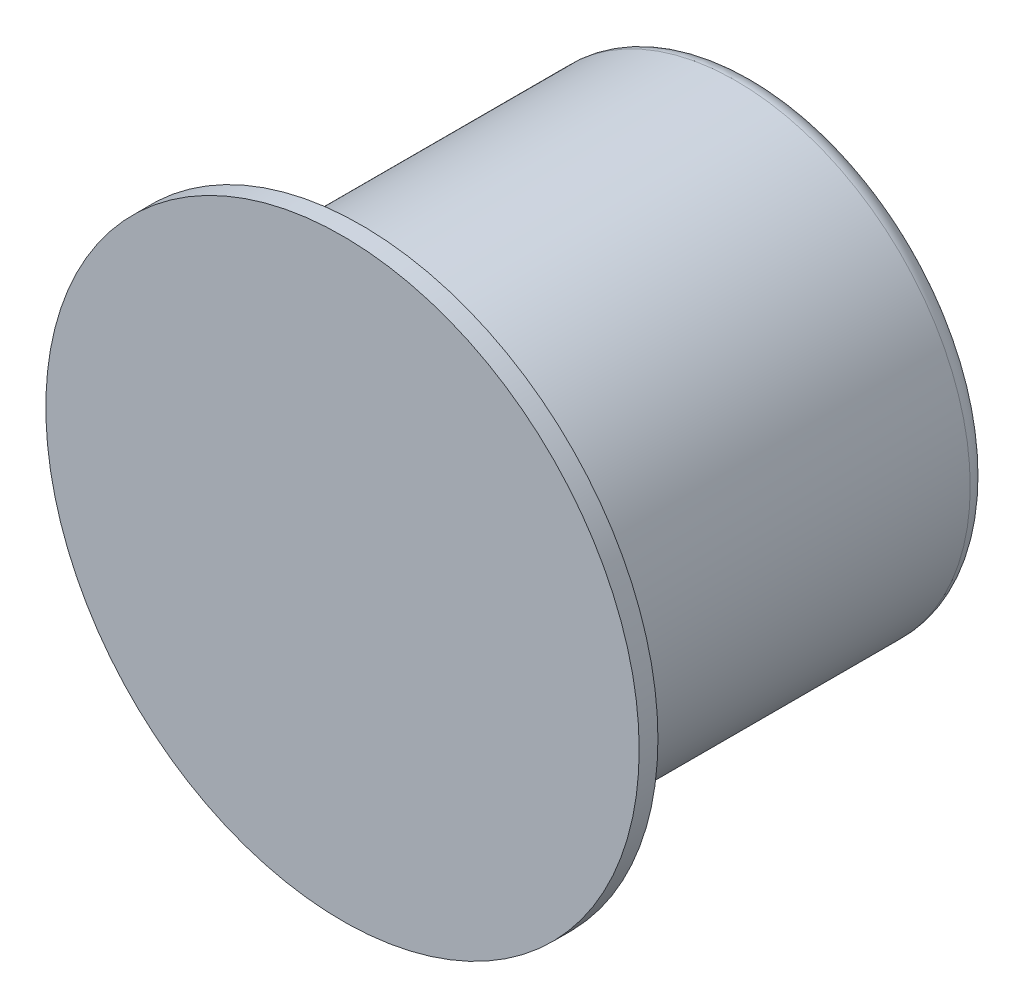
from build123d import *


with BuildPart() as part:
    # Sketch1 → Revolve1 (revolve)
    with BuildSketch(Plane(origin=(0, 0, 0), x_dir=(0, 0, -1), z_dir=(1, 0, 0)), mode=Mode.PRIVATE) as revolve1_sk:
        with BuildLine():
            Line((0, 0), (0, 47.5))
            Line((0, 47.5), (3, 47.5))
            Line((3, 47.5), (3, 37.5))
            Line((3, 37.5), (63, 37.5))
            ThreePointArc((63, 37.5), (65.121320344, 36.621320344), (66, 34.5))
            Line((66, 34.5), (66, 6))
            Line((66, 6), (65, 5))
            Line((65, 5), (54, 5))
            Line((54, 5), (51.113248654, 0))
            Line((51.113248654, 0), (0, 0))
        make_face()
    revolve(revolve1_sk.sketch.rotate(Axis((0, 0, 0), (0, 0, -1)), 90), axis=Axis((0, 0, 0), (0, 0, -1)))


solid = part.part
